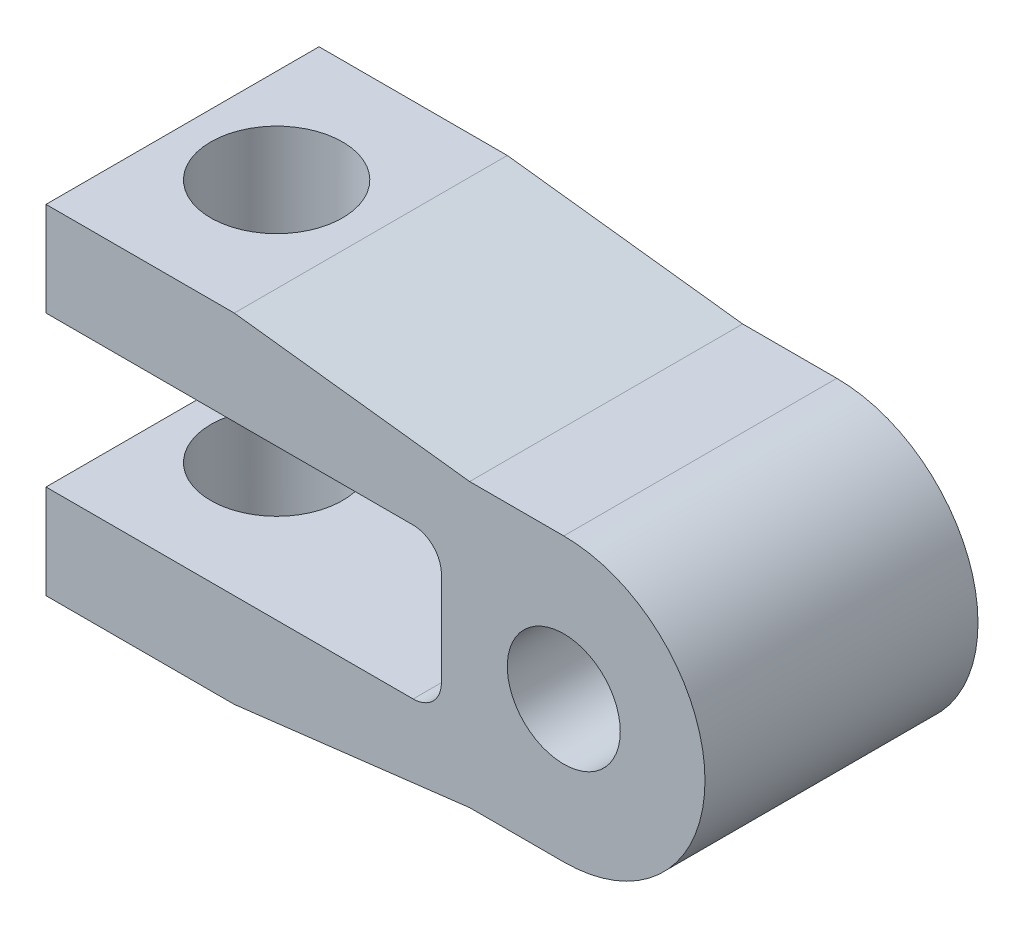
ISO-10303-21;
HEADER;
FILE_DESCRIPTION(('STEP AP214'),'2;1');
FILE_NAME('part.step','',(''),(''),'','','');
FILE_SCHEMA(('AUTOMOTIVE_DESIGN { 1 0 10303 214 1 1 1 1 }'));
ENDSEC;
DATA;
#1=APPLICATION_CONTEXT('core data for automotive mechanical design processes');
#2=APPLICATION_PROTOCOL_DEFINITION('international standard','automotive_design',2000,#1);
#3=PRODUCT_CONTEXT('',#1,'mechanical');
#4=PRODUCT('Part','Part','',(#3));
#5=PRODUCT_RELATED_PRODUCT_CATEGORY('part','',(#4));
#6=PRODUCT_DEFINITION_FORMATION('','',#4);
#7=PRODUCT_DEFINITION_CONTEXT('part definition',#1,'design');
#8=PRODUCT_DEFINITION('design','',#6,#7);
#9=PRODUCT_DEFINITION_SHAPE('','',#8);
#10=(LENGTH_UNIT() NAMED_UNIT(*) SI_UNIT(.MILLI.,.METRE.));
#11=(NAMED_UNIT(*) PLANE_ANGLE_UNIT() SI_UNIT($,.RADIAN.));
#12=(NAMED_UNIT(*) SI_UNIT($,.STERADIAN.) SOLID_ANGLE_UNIT());
#13=UNCERTAINTY_MEASURE_WITH_UNIT(LENGTH_MEASURE(1.E-05),#10,'distance_accuracy_value','');
#14=(GEOMETRIC_REPRESENTATION_CONTEXT(3) GLOBAL_UNCERTAINTY_ASSIGNED_CONTEXT((#13)) GLOBAL_UNIT_ASSIGNED_CONTEXT((#10,
#11,#12)) REPRESENTATION_CONTEXT('',''));
#15=CARTESIAN_POINT('',(0.,0.,0.));
#16=DIRECTION('',(0.,0.,1.));
#17=DIRECTION('',(1.,0.,0.));
#18=AXIS2_PLACEMENT_3D('',#15,#16,#17);
#19=CARTESIAN_POINT('',(-55.,8.,29.));
#20=DIRECTION('',(0.,1.,0.));
#21=DIRECTION('',(0.,0.,1.));
#22=AXIS2_PLACEMENT_3D('',#19,#20,#21);
#23=PLANE('',#22);
#24=CARTESIAN_POINT('',(-45.,8.,14.5));
#25=DIRECTION('',(0.,1.,0.));
#26=DIRECTION('',(0.,0.,1.));
#27=AXIS2_PLACEMENT_3D('',#24,#25,#26);
#28=CIRCLE('',#27,7.);
#29=CARTESIAN_POINT('',(-45.,8.,21.5));
#30=VERTEX_POINT('',#29);
#31=EDGE_CURVE('E261',#30,#30,#28,.T.);
#32=ORIENTED_EDGE('',*,*,#31,.T.);
#33=EDGE_LOOP('',(#32));
#34=FACE_BOUND('',#33,.T.);
#35=DIRECTION('',(1.,0.,0.));
#36=VECTOR('',#35,1.);
#37=CARTESIAN_POINT('',(-55.,8.,0.));
#38=LINE('',#37,#36);
#39=CARTESIAN_POINT('',(-55.,8.,0.));
#40=VERTEX_POINT('',#39);
#41=CARTESIAN_POINT('',(-16.,8.,0.));
#42=VERTEX_POINT('',#41);
#43=EDGE_CURVE('E250',#40,#42,#38,.T.);
#44=ORIENTED_EDGE('',*,*,#43,.T.);
#45=DIRECTION('',(0.,0.,-1.));
#46=VECTOR('',#45,1.);
#47=CARTESIAN_POINT('',(-16.,8.,29.));
#48=LINE('',#47,#46);
#49=CARTESIAN_POINT('',(-16.,8.,29.));
#50=VERTEX_POINT('',#49);
#51=EDGE_CURVE('E231',#42,#50,#48,.F.);
#52=ORIENTED_EDGE('',*,*,#51,.T.);
#53=DIRECTION('',(1.,0.,0.));
#54=VECTOR('',#53,1.);
#55=CARTESIAN_POINT('',(-55.,8.,29.));
#56=LINE('',#55,#54);
#57=CARTESIAN_POINT('',(-55.,8.,29.));
#58=VERTEX_POINT('',#57);
#59=EDGE_CURVE('E180',#58,#50,#56,.T.);
#60=ORIENTED_EDGE('',*,*,#59,.F.);
#61=DIRECTION('',(0.,0.,-1.));
#62=VECTOR('',#61,1.);
#63=CARTESIAN_POINT('',(-55.,8.,29.));
#64=LINE('',#63,#62);
#65=EDGE_CURVE('E204',#58,#40,#64,.T.);
#66=ORIENTED_EDGE('',*,*,#65,.T.);
#67=EDGE_LOOP('',(#44,#52,#60,#66));
#68=FACE_BOUND('',#67,.T.);
#69=ADVANCED_FACE('F37',(#34,#68),#23,.F.);
#70=CARTESIAN_POINT('',(-13.,8.,29.));
#71=DIRECTION('',(1.,0.,0.));
#72=DIRECTION('',(0.,1.,0.));
#73=AXIS2_PLACEMENT_3D('',#70,#71,#72);
#74=PLANE('',#73);
#75=DIRECTION('',(0.,-1.,0.));
#76=VECTOR('',#75,1.);
#77=CARTESIAN_POINT('',(-13.,8.,0.));
#78=LINE('',#77,#76);
#79=CARTESIAN_POINT('',(-13.,5.,0.));
#80=VERTEX_POINT('',#79);
#81=CARTESIAN_POINT('',(-13.,-5.,0.));
#82=VERTEX_POINT('',#81);
#83=EDGE_CURVE('E147',#80,#82,#78,.T.);
#84=ORIENTED_EDGE('',*,*,#83,.T.);
#85=DIRECTION('',(0.,0.,-1.));
#86=VECTOR('',#85,1.);
#87=CARTESIAN_POINT('',(-13.,-5.,29.));
#88=LINE('',#87,#86);
#89=CARTESIAN_POINT('',(-13.,-5.,29.));
#90=VERTEX_POINT('',#89);
#91=EDGE_CURVE('E57',#82,#90,#88,.F.);
#92=ORIENTED_EDGE('',*,*,#91,.T.);
#93=DIRECTION('',(0.,-1.,0.));
#94=VECTOR('',#93,1.);
#95=CARTESIAN_POINT('',(-13.,8.,29.));
#96=LINE('',#95,#94);
#97=CARTESIAN_POINT('',(-13.,5.,29.));
#98=VERTEX_POINT('',#97);
#99=EDGE_CURVE('E183',#98,#90,#96,.T.);
#100=ORIENTED_EDGE('',*,*,#99,.F.);
#101=DIRECTION('',(0.,0.,-1.));
#102=VECTOR('',#101,1.);
#103=CARTESIAN_POINT('',(-13.,5.,0.));
#104=LINE('',#103,#102);
#105=EDGE_CURVE('E154',#98,#80,#104,.T.);
#106=ORIENTED_EDGE('',*,*,#105,.T.);
#107=EDGE_LOOP('',(#84,#92,#100,#106));
#108=FACE_BOUND('',#107,.T.);
#109=ADVANCED_FACE('F246',(#108),#74,.F.);
#110=CARTESIAN_POINT('',(-55.,-8.,29.));
#111=DIRECTION('',(0.,-1.,0.));
#112=DIRECTION('',(0.,0.,-1.));
#113=AXIS2_PLACEMENT_3D('',#110,#111,#112);
#114=PLANE('',#113);
#115=CARTESIAN_POINT('',(-45.,-8.,14.5));
#116=DIRECTION('',(0.,-1.,0.));
#117=DIRECTION('',(0.,0.,-1.));
#118=AXIS2_PLACEMENT_3D('',#115,#116,#117);
#119=CIRCLE('',#118,7.);
#120=CARTESIAN_POINT('',(-45.,-8.,7.5));
#121=VERTEX_POINT('',#120);
#122=EDGE_CURVE('E264',#121,#121,#119,.T.);
#123=ORIENTED_EDGE('',*,*,#122,.T.);
#124=EDGE_LOOP('',(#123));
#125=FACE_BOUND('',#124,.T.);
#126=DIRECTION('',(-1.,0.,0.));
#127=VECTOR('',#126,1.);
#128=CARTESIAN_POINT('',(-55.,-8.,29.));
#129=LINE('',#128,#127);
#130=CARTESIAN_POINT('',(-16.,-8.,29.));
#131=VERTEX_POINT('',#130);
#132=CARTESIAN_POINT('',(-55.,-8.,29.));
#133=VERTEX_POINT('',#132);
#134=EDGE_CURVE('E185',#131,#133,#129,.T.);
#135=ORIENTED_EDGE('',*,*,#134,.F.);
#136=DIRECTION('',(0.,0.,-1.));
#137=VECTOR('',#136,1.);
#138=CARTESIAN_POINT('',(-16.,-8.,0.));
#139=LINE('',#138,#137);
#140=CARTESIAN_POINT('',(-16.,-8.,0.));
#141=VERTEX_POINT('',#140);
#142=EDGE_CURVE('E144',#131,#141,#139,.T.);
#143=ORIENTED_EDGE('',*,*,#142,.T.);
#144=DIRECTION('',(-1.,0.,0.));
#145=VECTOR('',#144,1.);
#146=CARTESIAN_POINT('',(-55.,-8.,0.));
#147=LINE('',#146,#145);
#148=CARTESIAN_POINT('',(-55.,-8.,0.));
#149=VERTEX_POINT('',#148);
#150=EDGE_CURVE('E137',#141,#149,#147,.T.);
#151=ORIENTED_EDGE('',*,*,#150,.T.);
#152=DIRECTION('',(0.,0.,-1.));
#153=VECTOR('',#152,1.);
#154=CARTESIAN_POINT('',(-55.,-8.,29.));
#155=LINE('',#154,#153);
#156=EDGE_CURVE('E141',#133,#149,#155,.T.);
#157=ORIENTED_EDGE('',*,*,#156,.F.);
#158=EDGE_LOOP('',(#135,#143,#151,#157));
#159=FACE_BOUND('',#158,.T.);
#160=ADVANCED_FACE('F140',(#125,#159),#114,.F.);
#161=CARTESIAN_POINT('',(-55.,-8.,29.));
#162=DIRECTION('',(1.,0.,0.));
#163=DIRECTION('',(0.,1.,0.));
#164=AXIS2_PLACEMENT_3D('',#161,#162,#163);
#165=PLANE('',#164);
#166=DIRECTION('',(0.,-1.,0.));
#167=VECTOR('',#166,1.);
#168=CARTESIAN_POINT('',(-55.,-8.,0.));
#169=LINE('',#168,#167);
#170=CARTESIAN_POINT('',(-55.,-18.,0.));
#171=VERTEX_POINT('',#170);
#172=EDGE_CURVE('E146',#149,#171,#169,.T.);
#173=ORIENTED_EDGE('',*,*,#172,.T.);
#174=DIRECTION('',(0.,0.,-1.));
#175=VECTOR('',#174,1.);
#176=CARTESIAN_POINT('',(-55.,-18.,29.));
#177=LINE('',#176,#175);
#178=CARTESIAN_POINT('',(-55.,-18.,29.));
#179=VERTEX_POINT('',#178);
#180=EDGE_CURVE('E155',#179,#171,#177,.T.);
#181=ORIENTED_EDGE('',*,*,#180,.F.);
#182=DIRECTION('',(0.,-1.,0.));
#183=VECTOR('',#182,1.);
#184=CARTESIAN_POINT('',(-55.,-8.,29.));
#185=LINE('',#184,#183);
#186=EDGE_CURVE('E153',#133,#179,#185,.T.);
#187=ORIENTED_EDGE('',*,*,#186,.F.);
#188=ORIENTED_EDGE('',*,*,#156,.T.);
#189=EDGE_LOOP('',(#173,#181,#187,#188));
#190=FACE_BOUND('',#189,.T.);
#191=ADVANCED_FACE('F150',(#190),#165,.F.);
#192=CARTESIAN_POINT('',(-55.,-18.,29.));
#193=DIRECTION('',(0.,1.,0.));
#194=DIRECTION('',(0.,0.,1.));
#195=AXIS2_PLACEMENT_3D('',#192,#193,#194);
#196=PLANE('',#195);
#197=CARTESIAN_POINT('',(-45.,-18.,14.5));
#198=DIRECTION('',(0.,1.,0.));
#199=DIRECTION('',(-1.,0.,0.));
#200=AXIS2_PLACEMENT_3D('',#197,#198,#199);
#201=CIRCLE('',#200,7.);
#202=CARTESIAN_POINT('',(-52.,-18.,14.5));
#203=VERTEX_POINT('',#202);
#204=EDGE_CURVE('E267',#203,#203,#201,.T.);
#205=ORIENTED_EDGE('',*,*,#204,.T.);
#206=EDGE_LOOP('',(#205));
#207=FACE_BOUND('',#206,.T.);
#208=DIRECTION('',(1.,0.,0.));
#209=VECTOR('',#208,1.);
#210=CARTESIAN_POINT('',(-55.,-18.,0.));
#211=LINE('',#210,#209);
#212=CARTESIAN_POINT('',(-35.,-18.,0.));
#213=VERTEX_POINT('',#212);
#214=EDGE_CURVE('E161',#171,#213,#211,.T.);
#215=ORIENTED_EDGE('',*,*,#214,.T.);
#216=DIRECTION('',(0.,0.,-1.));
#217=VECTOR('',#216,1.);
#218=CARTESIAN_POINT('',(-35.,-18.,29.));
#219=LINE('',#218,#217);
#220=CARTESIAN_POINT('',(-35.,-18.,29.));
#221=VERTEX_POINT('',#220);
#222=EDGE_CURVE('E225',#221,#213,#219,.T.);
#223=ORIENTED_EDGE('',*,*,#222,.F.);
#224=DIRECTION('',(1.,0.,0.));
#225=VECTOR('',#224,1.);
#226=CARTESIAN_POINT('',(-55.,-18.,29.));
#227=LINE('',#226,#225);
#228=EDGE_CURVE('E188',#179,#221,#227,.T.);
#229=ORIENTED_EDGE('',*,*,#228,.F.);
#230=ORIENTED_EDGE('',*,*,#180,.T.);
#231=EDGE_LOOP('',(#215,#223,#229,#230));
#232=FACE_BOUND('',#231,.T.);
#233=ADVANCED_FACE('F314',(#207,#232),#196,.F.);
#234=CARTESIAN_POINT('',(-35.,-18.,29.));
#235=DIRECTION('',(-0.119145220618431,0.992876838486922,0.));
#236=DIRECTION('',(-0.992876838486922,-0.119145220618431,0.));
#237=AXIS2_PLACEMENT_3D('',#234,#235,#236);
#238=PLANE('',#237);
#239=DIRECTION('',(0.992876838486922,0.119145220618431,0.));
#240=VECTOR('',#239,1.);
#241=CARTESIAN_POINT('',(-35.,-18.,0.));
#242=LINE('',#241,#240);
#243=CARTESIAN_POINT('',(-10.,-15.,0.));
#244=VERTEX_POINT('',#243);
#245=EDGE_CURVE('E163',#213,#244,#242,.T.);
#246=ORIENTED_EDGE('',*,*,#245,.T.);
#247=DIRECTION('',(0.,0.,-1.));
#248=VECTOR('',#247,1.);
#249=CARTESIAN_POINT('',(-10.,-15.,29.));
#250=LINE('',#249,#248);
#251=CARTESIAN_POINT('',(-10.,-15.,29.));
#252=VERTEX_POINT('',#251);
#253=EDGE_CURVE('E222',#252,#244,#250,.T.);
#254=ORIENTED_EDGE('',*,*,#253,.F.);
#255=DIRECTION('',(0.992876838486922,0.119145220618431,0.));
#256=VECTOR('',#255,1.);
#257=CARTESIAN_POINT('',(-35.,-18.,29.));
#258=LINE('',#257,#256);
#259=EDGE_CURVE('E190',#221,#252,#258,.T.);
#260=ORIENTED_EDGE('',*,*,#259,.F.);
#261=ORIENTED_EDGE('',*,*,#222,.T.);
#262=EDGE_LOOP('',(#246,#254,#260,#261));
#263=FACE_BOUND('',#262,.T.);
#264=ADVANCED_FACE('F309',(#263),#238,.F.);
#265=CARTESIAN_POINT('',(0.,-15.,29.));
#266=DIRECTION('',(0.,1.,0.));
#267=DIRECTION('',(-1.,0.,0.));
#268=AXIS2_PLACEMENT_3D('',#265,#266,#267);
#269=PLANE('',#268);
#270=DIRECTION('',(1.,0.,0.));
#271=VECTOR('',#270,1.);
#272=CARTESIAN_POINT('',(0.,-15.,0.));
#273=LINE('',#272,#271);
#274=CARTESIAN_POINT('',(0.,-15.,0.));
#275=VERTEX_POINT('',#274);
#276=EDGE_CURVE('E168',#244,#275,#273,.T.);
#277=ORIENTED_EDGE('',*,*,#276,.T.);
#278=DIRECTION('',(0.,0.,-1.));
#279=VECTOR('',#278,1.);
#280=CARTESIAN_POINT('',(0.,-15.,29.));
#281=LINE('',#280,#279);
#282=CARTESIAN_POINT('',(0.,-15.,29.));
#283=VERTEX_POINT('',#282);
#284=EDGE_CURVE('E219',#283,#275,#281,.T.);
#285=ORIENTED_EDGE('',*,*,#284,.F.);
#286=DIRECTION('',(1.,0.,0.));
#287=VECTOR('',#286,1.);
#288=CARTESIAN_POINT('',(0.,-15.,29.));
#289=LINE('',#288,#287);
#290=EDGE_CURVE('E192',#252,#283,#289,.T.);
#291=ORIENTED_EDGE('',*,*,#290,.F.);
#292=ORIENTED_EDGE('',*,*,#253,.T.);
#293=EDGE_LOOP('',(#277,#285,#291,#292));
#294=FACE_BOUND('',#293,.T.);
#295=ADVANCED_FACE('F306',(#294),#269,.F.);
#296=CARTESIAN_POINT('',(0.,0.,29.));
#297=DIRECTION('',(0.,0.,-1.));
#298=DIRECTION('',(-1.,0.,0.));
#299=AXIS2_PLACEMENT_3D('',#296,#297,#298);
#300=CYLINDRICAL_SURFACE('',#299,15.);
#301=CARTESIAN_POINT('',(0.,0.,0.));
#302=DIRECTION('',(0.,0.,1.));
#303=DIRECTION('',(1.,0.,0.));
#304=AXIS2_PLACEMENT_3D('',#301,#302,#303);
#305=CIRCLE('',#304,15.);
#306=CARTESIAN_POINT('',(0.,15.,0.));
#307=VERTEX_POINT('',#306);
#308=EDGE_CURVE('E170',#275,#307,#305,.T.);
#309=ORIENTED_EDGE('',*,*,#308,.T.);
#310=DIRECTION('',(0.,0.,-1.));
#311=VECTOR('',#310,1.);
#312=CARTESIAN_POINT('',(0.,15.,29.));
#313=LINE('',#312,#311);
#314=CARTESIAN_POINT('',(0.,15.,29.));
#315=VERTEX_POINT('',#314);
#316=EDGE_CURVE('E216',#315,#307,#313,.T.);
#317=ORIENTED_EDGE('',*,*,#316,.F.);
#318=CARTESIAN_POINT('',(0.,0.,29.));
#319=DIRECTION('',(0.,0.,1.));
#320=DIRECTION('',(1.,0.,0.));
#321=AXIS2_PLACEMENT_3D('',#318,#319,#320);
#322=CIRCLE('',#321,15.);
#323=EDGE_CURVE('E194',#283,#315,#322,.T.);
#324=ORIENTED_EDGE('',*,*,#323,.F.);
#325=ORIENTED_EDGE('',*,*,#284,.T.);
#326=EDGE_LOOP('',(#309,#317,#324,#325));
#327=FACE_BOUND('',#326,.T.);
#328=ADVANCED_FACE('F302',(#327),#300,.T.);
#329=CARTESIAN_POINT('',(0.,15.,29.));
#330=DIRECTION('',(0.,-1.,0.));
#331=DIRECTION('',(1.,0.,0.));
#332=AXIS2_PLACEMENT_3D('',#329,#330,#331);
#333=PLANE('',#332);
#334=DIRECTION('',(-1.,0.,0.));
#335=VECTOR('',#334,1.);
#336=CARTESIAN_POINT('',(0.,15.,0.));
#337=LINE('',#336,#335);
#338=CARTESIAN_POINT('',(-10.,15.,0.));
#339=VERTEX_POINT('',#338);
#340=EDGE_CURVE('E172',#307,#339,#337,.T.);
#341=ORIENTED_EDGE('',*,*,#340,.T.);
#342=DIRECTION('',(0.,0.,-1.));
#343=VECTOR('',#342,1.);
#344=CARTESIAN_POINT('',(-10.,15.,29.));
#345=LINE('',#344,#343);
#346=CARTESIAN_POINT('',(-10.,15.,29.));
#347=VERTEX_POINT('',#346);
#348=EDGE_CURVE('E213',#347,#339,#345,.T.);
#349=ORIENTED_EDGE('',*,*,#348,.F.);
#350=DIRECTION('',(-1.,0.,0.));
#351=VECTOR('',#350,1.);
#352=CARTESIAN_POINT('',(0.,15.,29.));
#353=LINE('',#352,#351);
#354=EDGE_CURVE('E196',#315,#347,#353,.T.);
#355=ORIENTED_EDGE('',*,*,#354,.F.);
#356=ORIENTED_EDGE('',*,*,#316,.T.);
#357=EDGE_LOOP('',(#341,#349,#355,#356));
#358=FACE_BOUND('',#357,.T.);
#359=ADVANCED_FACE('F298',(#358),#333,.F.);
#360=CARTESIAN_POINT('',(-35.,18.,29.));
#361=DIRECTION('',(-0.119145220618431,-0.992876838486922,0.));
#362=DIRECTION('',(0.992876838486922,-0.119145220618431,0.));
#363=AXIS2_PLACEMENT_3D('',#360,#361,#362);
#364=PLANE('',#363);
#365=DIRECTION('',(-0.992876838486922,0.119145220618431,0.));
#366=VECTOR('',#365,1.);
#367=CARTESIAN_POINT('',(-35.,18.,0.));
#368=LINE('',#367,#366);
#369=CARTESIAN_POINT('',(-35.,18.,0.));
#370=VERTEX_POINT('',#369);
#371=EDGE_CURVE('E174',#339,#370,#368,.T.);
#372=ORIENTED_EDGE('',*,*,#371,.T.);
#373=DIRECTION('',(0.,0.,-1.));
#374=VECTOR('',#373,1.);
#375=CARTESIAN_POINT('',(-35.,18.,29.));
#376=LINE('',#375,#374);
#377=CARTESIAN_POINT('',(-35.,18.,29.));
#378=VERTEX_POINT('',#377);
#379=EDGE_CURVE('E210',#378,#370,#376,.T.);
#380=ORIENTED_EDGE('',*,*,#379,.F.);
#381=DIRECTION('',(-0.992876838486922,0.119145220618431,0.));
#382=VECTOR('',#381,1.);
#383=CARTESIAN_POINT('',(-35.,18.,29.));
#384=LINE('',#383,#382);
#385=EDGE_CURVE('E198',#347,#378,#384,.T.);
#386=ORIENTED_EDGE('',*,*,#385,.F.);
#387=ORIENTED_EDGE('',*,*,#348,.T.);
#388=EDGE_LOOP('',(#372,#380,#386,#387));
#389=FACE_BOUND('',#388,.T.);
#390=ADVANCED_FACE('F281',(#389),#364,.F.);
#391=CARTESIAN_POINT('',(-55.,18.,29.));
#392=DIRECTION('',(0.,-1.,0.));
#393=DIRECTION('',(1.,0.,0.));
#394=AXIS2_PLACEMENT_3D('',#391,#392,#393);
#395=PLANE('',#394);
#396=CARTESIAN_POINT('',(-45.,18.,14.5));
#397=DIRECTION('',(0.,1.,0.));
#398=DIRECTION('',(-1.,0.,0.));
#399=AXIS2_PLACEMENT_3D('',#396,#397,#398);
#400=CIRCLE('',#399,7.);
#401=CARTESIAN_POINT('',(-52.,18.,14.5));
#402=VERTEX_POINT('',#401);
#403=EDGE_CURVE('E270',#402,#402,#400,.T.);
#404=ORIENTED_EDGE('',*,*,#403,.F.);
#405=EDGE_LOOP('',(#404));
#406=FACE_BOUND('',#405,.T.);
#407=DIRECTION('',(-1.,0.,0.));
#408=VECTOR('',#407,1.);
#409=CARTESIAN_POINT('',(-55.,18.,0.));
#410=LINE('',#409,#408);
#411=CARTESIAN_POINT('',(-55.,18.,0.));
#412=VERTEX_POINT('',#411);
#413=EDGE_CURVE('E176',#370,#412,#410,.T.);
#414=ORIENTED_EDGE('',*,*,#413,.T.);
#415=DIRECTION('',(0.,0.,-1.));
#416=VECTOR('',#415,1.);
#417=CARTESIAN_POINT('',(-55.,18.,29.));
#418=LINE('',#417,#416);
#419=CARTESIAN_POINT('',(-55.,18.,29.));
#420=VERTEX_POINT('',#419);
#421=EDGE_CURVE('E207',#420,#412,#418,.T.);
#422=ORIENTED_EDGE('',*,*,#421,.F.);
#423=DIRECTION('',(-1.,0.,0.));
#424=VECTOR('',#423,1.);
#425=CARTESIAN_POINT('',(-55.,18.,29.));
#426=LINE('',#425,#424);
#427=EDGE_CURVE('E200',#378,#420,#426,.T.);
#428=ORIENTED_EDGE('',*,*,#427,.F.);
#429=ORIENTED_EDGE('',*,*,#379,.T.);
#430=EDGE_LOOP('',(#414,#422,#428,#429));
#431=FACE_BOUND('',#430,.T.);
#432=ADVANCED_FACE('F277',(#406,#431),#395,.F.);
#433=CARTESIAN_POINT('',(-55.,18.,29.));
#434=DIRECTION('',(1.,0.,0.));
#435=DIRECTION('',(0.,0.,-1.));
#436=AXIS2_PLACEMENT_3D('',#433,#434,#435);
#437=PLANE('',#436);
#438=DIRECTION('',(0.,-1.,0.));
#439=VECTOR('',#438,1.);
#440=CARTESIAN_POINT('',(-55.,18.,0.));
#441=LINE('',#440,#439);
#442=EDGE_CURVE('E178',#412,#40,#441,.T.);
#443=ORIENTED_EDGE('',*,*,#442,.T.);
#444=ORIENTED_EDGE('',*,*,#65,.F.);
#445=DIRECTION('',(0.,-1.,0.));
#446=VECTOR('',#445,1.);
#447=CARTESIAN_POINT('',(-55.,18.,29.));
#448=LINE('',#447,#446);
#449=EDGE_CURVE('E202',#420,#58,#448,.T.);
#450=ORIENTED_EDGE('',*,*,#449,.F.);
#451=ORIENTED_EDGE('',*,*,#421,.T.);
#452=EDGE_LOOP('',(#443,#444,#450,#451));
#453=FACE_BOUND('',#452,.T.);
#454=ADVANCED_FACE('F280',(#453),#437,.F.);
#455=CARTESIAN_POINT('',(0.,0.,29.));
#456=DIRECTION('',(0.,0.,1.));
#457=DIRECTION('',(1.,0.,0.));
#458=AXIS2_PLACEMENT_3D('',#455,#456,#457);
#459=PLANE('',#458);
#460=CARTESIAN_POINT('',(0.,0.,29.));
#461=DIRECTION('',(0.,0.,1.));
#462=DIRECTION('',(1.,0.,0.));
#463=AXIS2_PLACEMENT_3D('',#460,#461,#462);
#464=CIRCLE('',#463,6.);
#465=CARTESIAN_POINT('',(6.,0.,29.));
#466=VERTEX_POINT('',#465);
#467=EDGE_CURVE('E256',#466,#466,#464,.T.);
#468=ORIENTED_EDGE('',*,*,#467,.F.);
#469=EDGE_LOOP('',(#468));
#470=FACE_BOUND('',#469,.T.);
#471=ORIENTED_EDGE('',*,*,#59,.T.);
#472=CARTESIAN_POINT('',(-16.,5.,29.));
#473=DIRECTION('',(0.,0.,1.));
#474=DIRECTION('',(1.,0.,0.));
#475=AXIS2_PLACEMENT_3D('',#472,#473,#474);
#476=CIRCLE('',#475,3.);
#477=EDGE_CURVE('E235',#50,#98,#476,.F.);
#478=ORIENTED_EDGE('',*,*,#477,.T.);
#479=ORIENTED_EDGE('',*,*,#99,.T.);
#480=CARTESIAN_POINT('',(-16.,-5.,29.));
#481=DIRECTION('',(0.,0.,1.));
#482=DIRECTION('',(1.,0.,0.));
#483=AXIS2_PLACEMENT_3D('',#480,#481,#482);
#484=CIRCLE('',#483,3.);
#485=EDGE_CURVE('E11',#90,#131,#484,.F.);
#486=ORIENTED_EDGE('',*,*,#485,.T.);
#487=ORIENTED_EDGE('',*,*,#134,.T.);
#488=ORIENTED_EDGE('',*,*,#186,.T.);
#489=ORIENTED_EDGE('',*,*,#228,.T.);
#490=ORIENTED_EDGE('',*,*,#259,.T.);
#491=ORIENTED_EDGE('',*,*,#290,.T.);
#492=ORIENTED_EDGE('',*,*,#323,.T.);
#493=ORIENTED_EDGE('',*,*,#354,.T.);
#494=ORIENTED_EDGE('',*,*,#385,.T.);
#495=ORIENTED_EDGE('',*,*,#427,.T.);
#496=ORIENTED_EDGE('',*,*,#449,.T.);
#497=EDGE_LOOP('',(#471,#478,#479,#486,#487,#488,#489,#490,#491,#492,#493,#494,#495,#496));
#498=FACE_BOUND('',#497,.T.);
#499=ADVANCED_FACE('F240',(#470,#498),#459,.T.);
#500=CARTESIAN_POINT('',(0.,0.,0.));
#501=DIRECTION('',(0.,0.,1.));
#502=DIRECTION('',(1.,0.,0.));
#503=AXIS2_PLACEMENT_3D('',#500,#501,#502);
#504=PLANE('',#503);
#505=CARTESIAN_POINT('',(0.,0.,0.));
#506=DIRECTION('',(0.,0.,1.));
#507=DIRECTION('',(1.,0.,0.));
#508=AXIS2_PLACEMENT_3D('',#505,#506,#507);
#509=CIRCLE('',#508,6.);
#510=CARTESIAN_POINT('',(6.,0.,0.));
#511=VERTEX_POINT('',#510);
#512=EDGE_CURVE('E253',#511,#511,#509,.T.);
#513=ORIENTED_EDGE('',*,*,#512,.T.);
#514=EDGE_LOOP('',(#513));
#515=FACE_BOUND('',#514,.T.);
#516=ORIENTED_EDGE('',*,*,#43,.F.);
#517=ORIENTED_EDGE('',*,*,#442,.F.);
#518=ORIENTED_EDGE('',*,*,#413,.F.);
#519=ORIENTED_EDGE('',*,*,#371,.F.);
#520=ORIENTED_EDGE('',*,*,#340,.F.);
#521=ORIENTED_EDGE('',*,*,#308,.F.);
#522=ORIENTED_EDGE('',*,*,#276,.F.);
#523=ORIENTED_EDGE('',*,*,#245,.F.);
#524=ORIENTED_EDGE('',*,*,#214,.F.);
#525=ORIENTED_EDGE('',*,*,#172,.F.);
#526=ORIENTED_EDGE('',*,*,#150,.F.);
#527=CARTESIAN_POINT('',(-16.,-5.,0.));
#528=DIRECTION('',(0.,0.,1.));
#529=DIRECTION('',(1.,0.,0.));
#530=AXIS2_PLACEMENT_3D('',#527,#528,#529);
#531=CIRCLE('',#530,3.);
#532=EDGE_CURVE('E44',#141,#82,#531,.T.);
#533=ORIENTED_EDGE('',*,*,#532,.T.);
#534=ORIENTED_EDGE('',*,*,#83,.F.);
#535=CARTESIAN_POINT('',(-16.,5.,0.));
#536=DIRECTION('',(0.,0.,1.));
#537=DIRECTION('',(1.,0.,0.));
#538=AXIS2_PLACEMENT_3D('',#535,#536,#537);
#539=CIRCLE('',#538,3.);
#540=EDGE_CURVE('E233',#80,#42,#539,.T.);
#541=ORIENTED_EDGE('',*,*,#540,.T.);
#542=EDGE_LOOP('',(#516,#517,#518,#519,#520,#521,#522,#523,#524,#525,#526,#533,#534,#541));
#543=FACE_BOUND('',#542,.T.);
#544=ADVANCED_FACE('F159',(#515,#543),#504,.F.);
#545=CARTESIAN_POINT('',(-16.,5.,29.));
#546=DIRECTION('',(0.,0.,1.));
#547=DIRECTION('',(1.,0.,0.));
#548=AXIS2_PLACEMENT_3D('',#545,#546,#547);
#549=CYLINDRICAL_SURFACE('',#548,3.);
#550=ORIENTED_EDGE('',*,*,#477,.F.);
#551=ORIENTED_EDGE('',*,*,#51,.F.);
#552=ORIENTED_EDGE('',*,*,#540,.F.);
#553=ORIENTED_EDGE('',*,*,#105,.F.);
#554=EDGE_LOOP('',(#550,#551,#552,#553));
#555=FACE_BOUND('',#554,.T.);
#556=ADVANCED_FACE('F247',(#555),#549,.F.);
#557=CARTESIAN_POINT('',(-16.,-5.,29.));
#558=DIRECTION('',(0.,0.,1.));
#559=DIRECTION('',(1.,0.,0.));
#560=AXIS2_PLACEMENT_3D('',#557,#558,#559);
#561=CYLINDRICAL_SURFACE('',#560,3.);
#562=ORIENTED_EDGE('',*,*,#485,.F.);
#563=ORIENTED_EDGE('',*,*,#91,.F.);
#564=ORIENTED_EDGE('',*,*,#532,.F.);
#565=ORIENTED_EDGE('',*,*,#142,.F.);
#566=EDGE_LOOP('',(#562,#563,#564,#565));
#567=FACE_BOUND('',#566,.T.);
#568=ADVANCED_FACE('F316',(#567),#561,.F.);
#569=CARTESIAN_POINT('',(0.,0.,0.));
#570=DIRECTION('',(0.,0.,1.));
#571=DIRECTION('',(1.,0.,0.));
#572=AXIS2_PLACEMENT_3D('',#569,#570,#571);
#573=CYLINDRICAL_SURFACE('',#572,6.);
#574=CARTESIAN_POINT('',(6.,0.,0.));
#575=CARTESIAN_POINT('',(6.,0.,0.302083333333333));
#576=CARTESIAN_POINT('',(6.,0.,0.604166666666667));
#577=CARTESIAN_POINT('',(6.,0.,1.20833333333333));
#578=CARTESIAN_POINT('',(6.,0.,1.51041666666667));
#579=CARTESIAN_POINT('',(6.,0.,2.11458333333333));
#580=CARTESIAN_POINT('',(6.,0.,2.41666666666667));
#581=CARTESIAN_POINT('',(6.,0.,3.02083333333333));
#582=CARTESIAN_POINT('',(6.,0.,3.32291666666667));
#583=CARTESIAN_POINT('',(6.,0.,3.92708333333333));
#584=CARTESIAN_POINT('',(6.,0.,4.22916666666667));
#585=CARTESIAN_POINT('',(6.,0.,4.83333333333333));
#586=CARTESIAN_POINT('',(6.,0.,5.13541666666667));
#587=CARTESIAN_POINT('',(6.,0.,5.73958333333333));
#588=CARTESIAN_POINT('',(6.,0.,6.04166666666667));
#589=CARTESIAN_POINT('',(6.,0.,6.64583333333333));
#590=CARTESIAN_POINT('',(6.,0.,6.94791666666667));
#591=CARTESIAN_POINT('',(6.,0.,7.55208333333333));
#592=CARTESIAN_POINT('',(6.,0.,7.85416666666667));
#593=CARTESIAN_POINT('',(6.,0.,8.45833333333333));
#594=CARTESIAN_POINT('',(6.,0.,8.76041666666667));
#595=CARTESIAN_POINT('',(6.,0.,9.36458333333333));
#596=CARTESIAN_POINT('',(6.,0.,9.66666666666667));
#597=CARTESIAN_POINT('',(6.,0.,10.2708333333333));
#598=CARTESIAN_POINT('',(6.,0.,10.5729166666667));
#599=CARTESIAN_POINT('',(6.,0.,11.1770833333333));
#600=CARTESIAN_POINT('',(6.,0.,11.4791666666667));
#601=CARTESIAN_POINT('',(6.,0.,12.0833333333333));
#602=CARTESIAN_POINT('',(6.,0.,12.3854166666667));
#603=CARTESIAN_POINT('',(6.,0.,12.9895833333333));
#604=CARTESIAN_POINT('',(6.,0.,13.2916666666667));
#605=CARTESIAN_POINT('',(6.,0.,13.8958333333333));
#606=CARTESIAN_POINT('',(6.,0.,14.1979166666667));
#607=CARTESIAN_POINT('',(6.,0.,14.8020833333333));
#608=CARTESIAN_POINT('',(6.,0.,15.1041666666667));
#609=CARTESIAN_POINT('',(6.,0.,15.7083333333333));
#610=CARTESIAN_POINT('',(6.,0.,16.0104166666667));
#611=CARTESIAN_POINT('',(6.,0.,16.6145833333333));
#612=CARTESIAN_POINT('',(6.,0.,16.9166666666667));
#613=CARTESIAN_POINT('',(6.,0.,17.5208333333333));
#614=CARTESIAN_POINT('',(6.,0.,17.8229166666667));
#615=CARTESIAN_POINT('',(6.,0.,18.4270833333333));
#616=CARTESIAN_POINT('',(6.,0.,18.7291666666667));
#617=CARTESIAN_POINT('',(6.,0.,19.3333333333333));
#618=CARTESIAN_POINT('',(6.,0.,19.6354166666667));
#619=CARTESIAN_POINT('',(6.,0.,20.2395833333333));
#620=CARTESIAN_POINT('',(6.,0.,20.5416666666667));
#621=CARTESIAN_POINT('',(6.,0.,21.1458333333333));
#622=CARTESIAN_POINT('',(6.,0.,21.4479166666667));
#623=CARTESIAN_POINT('',(6.,0.,22.0520833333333));
#624=CARTESIAN_POINT('',(6.,0.,22.3541666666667));
#625=CARTESIAN_POINT('',(6.,0.,22.9583333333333));
#626=CARTESIAN_POINT('',(6.,0.,23.2604166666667));
#627=CARTESIAN_POINT('',(6.,0.,23.8645833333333));
#628=CARTESIAN_POINT('',(6.,0.,24.1666666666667));
#629=CARTESIAN_POINT('',(6.,0.,24.7708333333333));
#630=CARTESIAN_POINT('',(6.,0.,25.0729166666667));
#631=CARTESIAN_POINT('',(6.,0.,25.6770833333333));
#632=CARTESIAN_POINT('',(6.,0.,25.9791666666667));
#633=CARTESIAN_POINT('',(6.,0.,26.5833333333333));
#634=CARTESIAN_POINT('',(6.,0.,26.8854166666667));
#635=CARTESIAN_POINT('',(6.,0.,27.4895833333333));
#636=CARTESIAN_POINT('',(6.,0.,27.7916666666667));
#637=CARTESIAN_POINT('',(6.,0.,28.3958333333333));
#638=CARTESIAN_POINT('',(6.,0.,28.6979166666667));
#639=CARTESIAN_POINT('',(6.,0.,29.));
#640=B_SPLINE_CURVE_WITH_KNOTS('',3,(#574,#575,#576,#577,#578,#579,#580,#581,#582,#583,#584,
#585,#586,#587,#588,#589,#590,#591,#592,#593,#594,#595,#596,#597,#598,#599,#600,#601,#602,#603,
#604,#605,#606,#607,#608,#609,#610,#611,#612,#613,#614,#615,#616,#617,#618,#619,#620,#621,#622,
#623,#624,#625,#626,#627,#628,#629,#630,#631,#632,#633,#634,#635,#636,#637,#638,#639),
.UNSPECIFIED.,.F.,.F.,(4,2,2,2,2,2,2,2,2,2,2,2,2,2,2,2,2,2,2,2,2,2,2,2,2,2,2,2,2,2,2,2,4),(0.,
0.90625,1.8125,2.71875,3.625,4.53125,5.4375,6.34375,7.25,8.15625,9.0625,9.96875,10.875,11.78125,
12.6875,13.59375,14.5,15.40625,16.3125,17.21875,18.125,19.03125,19.9375,20.84375,21.75,22.65625,
23.5625,24.46875,25.375,26.28125,27.1875,28.09375,29.),.UNSPECIFIED.);
#641=EDGE_CURVE('BSEAM318',#511,#466,#640,.T.);
#642=ORIENTED_EDGE('',*,*,#512,.F.);
#643=ORIENTED_EDGE('',*,*,#467,.T.);
#644=ORIENTED_EDGE('',*,*,#641,.T.);
#645=ORIENTED_EDGE('',*,*,#641,.F.);
#646=EDGE_LOOP('',(#642,#644,#643,#645));
#647=FACE_BOUND('',#646,.T.);
#648=ADVANCED_FACE('F318',(#647),#573,.F.);
#649=CARTESIAN_POINT('',(-45.,-18.,14.5));
#650=DIRECTION('',(0.,1.,0.));
#651=DIRECTION('',(-1.,0.,0.));
#652=AXIS2_PLACEMENT_3D('',#649,#650,#651);
#653=CYLINDRICAL_SURFACE('',#652,7.);
#654=ORIENTED_EDGE('',*,*,#403,.T.);
#655=EDGE_LOOP('',(#654));
#656=FACE_BOUND('',#655,.T.);
#657=ORIENTED_EDGE('',*,*,#31,.F.);
#658=EDGE_LOOP('',(#657));
#659=FACE_BOUND('',#658,.T.);
#660=ADVANCED_FACE('F274',(#656,#659),#653,.F.);
#661=ORIENTED_EDGE('',*,*,#204,.F.);
#662=EDGE_LOOP('',(#661));
#663=FACE_BOUND('',#662,.T.);
#664=ORIENTED_EDGE('',*,*,#122,.F.);
#665=EDGE_LOOP('',(#664));
#666=FACE_BOUND('',#665,.T.);
#667=ADVANCED_FACE('F334',(#663,#666),#653,.F.);
#668=CLOSED_SHELL('',(#69,#109,#160,#191,#233,#264,#295,#328,#359,#390,#432,#454,#499,#544,#556,
#568,#648,#660,#667));
#669=MANIFOLD_SOLID_BREP('B2',#668);
#670=ADVANCED_BREP_SHAPE_REPRESENTATION('',(#18,#669),#14);
#671=SHAPE_DEFINITION_REPRESENTATION(#9,#670);
ENDSEC;
END-ISO-10303-21;
